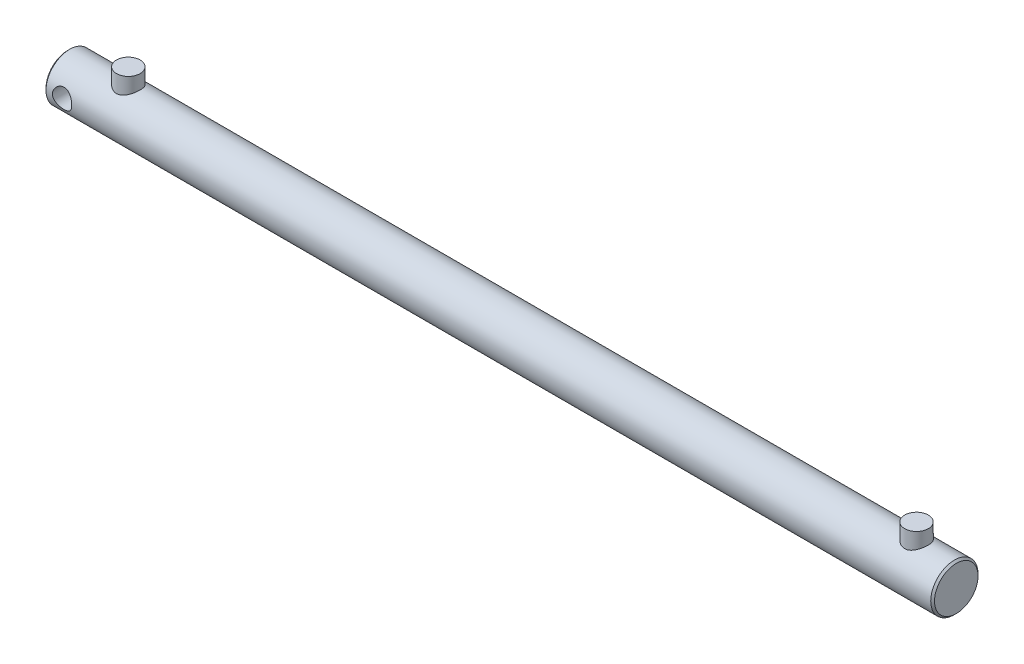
ISO-10303-21;
HEADER;
FILE_DESCRIPTION(('STEP AP214'),'2;1');
FILE_NAME('part.step','',(''),(''),'','','');
FILE_SCHEMA(('AUTOMOTIVE_DESIGN { 1 0 10303 214 1 1 1 1 }'));
ENDSEC;
DATA;
#1=APPLICATION_CONTEXT('core data for automotive mechanical design processes');
#2=APPLICATION_PROTOCOL_DEFINITION('international standard','automotive_design',2000,#1);
#3=PRODUCT_CONTEXT('',#1,'mechanical');
#4=PRODUCT('Part','Part','',(#3));
#5=PRODUCT_RELATED_PRODUCT_CATEGORY('part','',(#4));
#6=PRODUCT_DEFINITION_FORMATION('','',#4);
#7=PRODUCT_DEFINITION_CONTEXT('part definition',#1,'design');
#8=PRODUCT_DEFINITION('design','',#6,#7);
#9=PRODUCT_DEFINITION_SHAPE('','',#8);
#10=(LENGTH_UNIT() NAMED_UNIT(*) SI_UNIT(.MILLI.,.METRE.));
#11=(NAMED_UNIT(*) PLANE_ANGLE_UNIT() SI_UNIT($,.RADIAN.));
#12=(NAMED_UNIT(*) SI_UNIT($,.STERADIAN.) SOLID_ANGLE_UNIT());
#13=UNCERTAINTY_MEASURE_WITH_UNIT(LENGTH_MEASURE(1.E-05),#10,'distance_accuracy_value','');
#14=(GEOMETRIC_REPRESENTATION_CONTEXT(3) GLOBAL_UNCERTAINTY_ASSIGNED_CONTEXT((#13)) GLOBAL_UNIT_ASSIGNED_CONTEXT((#10,
#11,#12)) REPRESENTATION_CONTEXT('',''));
#15=CARTESIAN_POINT('',(0.,0.,0.));
#16=DIRECTION('',(0.,0.,1.));
#17=DIRECTION('',(1.,0.,0.));
#18=AXIS2_PLACEMENT_3D('',#15,#16,#17);
#19=CARTESIAN_POINT('',(-469.5,0.,0.));
#20=DIRECTION('',(-1.,0.,0.));
#21=DIRECTION('',(0.,0.,1.));
#22=AXIS2_PLACEMENT_3D('',#19,#20,#21);
#23=CYLINDRICAL_SURFACE('',#22,25.);
#24=CARTESIAN_POINT('',(-405.5,21.650635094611,-12.5));
#25=CARTESIAN_POINT('',(-405.825828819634,21.650636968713,-12.4999985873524));
#26=CARTESIAN_POINT('',(-406.151686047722,21.6580155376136,-12.4872432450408));
#27=CARTESIAN_POINT('',(-406.800889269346,21.6872558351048,-12.4363891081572));
#28=CARTESIAN_POINT('',(-407.12423402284,21.7091243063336,-12.3982785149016));
#29=CARTESIAN_POINT('',(-407.766364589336,21.7665787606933,-12.297130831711));
#30=CARTESIAN_POINT('',(-408.085140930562,21.802189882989,-12.2340480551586));
#31=CARTESIAN_POINT('',(-408.715226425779,21.8858435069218,-12.0837589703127));
#32=CARTESIAN_POINT('',(-409.026536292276,21.9338848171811,-11.9965549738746));
#33=CARTESIAN_POINT('',(-409.638091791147,22.0405000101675,-11.7995262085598));
#34=CARTESIAN_POINT('',(-409.938389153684,22.0990140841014,-11.6898294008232));
#35=CARTESIAN_POINT('',(-410.528172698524,22.2249725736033,-11.4485414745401));
#36=CARTESIAN_POINT('',(-410.817654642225,22.2924204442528,-11.3169418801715));
#37=CARTESIAN_POINT('',(-411.667464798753,22.5052717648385,-10.8909843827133));
#38=CARTESIAN_POINT('',(-412.2097361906,22.6612898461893,-10.5652792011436));
#39=CARTESIAN_POINT('',(-413.278979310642,22.9996468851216,-9.80822889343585));
#40=CARTESIAN_POINT('',(-413.801000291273,23.1830954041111,-9.37038644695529));
#41=CARTESIAN_POINT('',(-414.525932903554,23.4556474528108,-8.65437620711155));
#42=CARTESIAN_POINT('',(-414.758042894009,23.5461267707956,-8.4056273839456));
#43=CARTESIAN_POINT('',(-415.201667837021,23.7240607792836,-7.8894445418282));
#44=CARTESIAN_POINT('',(-415.413190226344,23.8115165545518,-7.62201733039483));
#45=CARTESIAN_POINT('',(-415.827960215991,23.9870610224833,-7.05096348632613));
#46=CARTESIAN_POINT('',(-416.029675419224,24.0747909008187,-6.74611185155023));
#47=CARTESIAN_POINT('',(-416.406506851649,24.2419754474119,-6.11818329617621));
#48=CARTESIAN_POINT('',(-416.581621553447,24.3214296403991,-5.79510533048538));
#49=CARTESIAN_POINT('',(-416.90343651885,24.4697359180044,-5.13293948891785));
#50=CARTESIAN_POINT('',(-417.050150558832,24.5385931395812,-4.7938594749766));
#51=CARTESIAN_POINT('',(-417.313578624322,24.6636816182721,-4.10199116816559));
#52=CARTESIAN_POINT('',(-417.430295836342,24.7199142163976,-3.7492043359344));
#53=CARTESIAN_POINT('',(-417.625035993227,24.8145076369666,-3.05827019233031));
#54=CARTESIAN_POINT('',(-417.705220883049,24.8538552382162,-2.72086672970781));
#55=CARTESIAN_POINT('',(-417.837413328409,24.9190379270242,-2.03929145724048));
#56=CARTESIAN_POINT('',(-417.889422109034,24.9448736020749,-1.69511994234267));
#57=CARTESIAN_POINT('',(-417.964549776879,24.9822725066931,-1.0030426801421));
#58=CARTESIAN_POINT('',(-417.987683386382,24.9938430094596,-0.655138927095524));
#59=CARTESIAN_POINT('',(-418.004785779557,25.0023919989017,0.0415551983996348));
#60=CARTESIAN_POINT('',(-417.998756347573,24.9993713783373,0.390345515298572));
#61=CARTESIAN_POINT('',(-417.959420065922,24.9797298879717,1.05545670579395));
#62=CARTESIAN_POINT('',(-417.928534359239,24.9643162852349,1.37196006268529));
#63=CARTESIAN_POINT('',(-417.842896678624,24.9217919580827,2.00090286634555));
#64=CARTESIAN_POINT('',(-417.788146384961,24.8946820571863,2.31334259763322));
#65=CARTESIAN_POINT('',(-417.655375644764,24.8294144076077,2.932058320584));
#66=CARTESIAN_POINT('',(-417.577354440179,24.7912562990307,3.2383341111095));
#67=CARTESIAN_POINT('',(-417.398835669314,24.7047808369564,3.84278923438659));
#68=CARTESIAN_POINT('',(-417.298337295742,24.6564631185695,4.14096827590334));
#69=CARTESIAN_POINT('',(-417.074267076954,24.5500266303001,4.73153890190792));
#70=CARTESIAN_POINT('',(-416.95039676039,24.4917821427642,5.02379438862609));
#71=CARTESIAN_POINT('',(-416.681577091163,24.367262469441,5.59664626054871));
#72=CARTESIAN_POINT('',(-416.536627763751,24.3009872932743,5.87724265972));
#73=CARTESIAN_POINT('',(-416.226722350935,24.1618170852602,6.42546402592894));
#74=CARTESIAN_POINT('',(-416.061764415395,24.0889214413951,6.69308779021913));
#75=CARTESIAN_POINT('',(-415.712866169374,23.9380009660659,7.21427443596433));
#76=CARTESIAN_POINT('',(-415.528918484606,23.859974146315,7.46783179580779));
#77=CARTESIAN_POINT('',(-415.124909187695,23.6928666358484,7.98299107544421));
#78=CARTESIAN_POINT('',(-414.903077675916,23.6034377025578,8.24309375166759));
#79=CARTESIAN_POINT('',(-414.439270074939,23.4225308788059,8.74390948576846));
#80=CARTESIAN_POINT('',(-414.197292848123,23.331052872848,8.9846214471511));
#81=CARTESIAN_POINT('',(-413.694268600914,23.1482419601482,9.44565668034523));
#82=CARTESIAN_POINT('',(-413.433209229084,23.0569091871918,9.66596653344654));
#83=CARTESIAN_POINT('',(-412.893337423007,22.876771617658,10.0849060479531));
#84=CARTESIAN_POINT('',(-412.614521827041,22.7879672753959,10.2835318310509));
#85=CARTESIAN_POINT('',(-412.022086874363,22.6097947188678,10.6698301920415));
#86=CARTESIAN_POINT('',(-411.70738198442,22.520752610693,10.8559934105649));
#87=CARTESIAN_POINT('',(-411.061183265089,22.3512779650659,11.2007713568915));
#88=CARTESIAN_POINT('',(-410.729697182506,22.2708415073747,11.3593986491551));
#89=CARTESIAN_POINT('',(-410.051996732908,22.1215174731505,11.6475234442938));
#90=CARTESIAN_POINT('',(-409.705791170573,22.0526231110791,11.7770380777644));
#91=CARTESIAN_POINT('',(-409.000945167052,21.9291206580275,12.0054389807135));
#92=CARTESIAN_POINT('',(-408.642306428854,21.8745106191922,12.1043294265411));
#93=CARTESIAN_POINT('',(-407.944369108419,21.7856557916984,12.26347567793));
#94=CARTESIAN_POINT('',(-407.605788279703,21.7501406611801,12.3261709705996));
#95=CARTESIAN_POINT('',(-406.923342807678,21.6947067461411,12.4234802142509));
#96=CARTESIAN_POINT('',(-406.579478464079,21.6747870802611,12.4580957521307));
#97=CARTESIAN_POINT('',(-405.889711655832,21.6514003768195,12.4986965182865));
#98=CARTESIAN_POINT('',(-405.543810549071,21.6479233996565,12.5046990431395));
#99=CARTESIAN_POINT('',(-404.852946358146,21.6575485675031,12.4880218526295));
#100=CARTESIAN_POINT('',(-404.507983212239,21.6706495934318,12.4653440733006));
#101=CARTESIAN_POINT('',(-403.859787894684,21.71053573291,12.3957257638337));
#102=CARTESIAN_POINT('',(-403.556131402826,21.7356609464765,12.3517217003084));
#103=CARTESIAN_POINT('',(-402.953946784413,21.7977675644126,12.2417856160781));
#104=CARTESIAN_POINT('',(-402.655420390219,21.8347528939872,12.1758463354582));
#105=CARTESIAN_POINT('',(-402.065469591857,21.919415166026,12.0227647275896));
#106=CARTESIAN_POINT('',(-401.774044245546,21.967090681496,11.9356252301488));
#107=CARTESIAN_POINT('',(-401.199706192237,22.0717635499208,11.7409310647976));
#108=CARTESIAN_POINT('',(-400.916796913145,22.12876459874,11.6333683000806));
#109=CARTESIAN_POINT('',(-400.348184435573,22.2533312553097,11.3933466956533));
#110=CARTESIAN_POINT('',(-400.062947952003,22.3212614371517,11.2599724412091));
#111=CARTESIAN_POINT('',(-399.504535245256,22.4638079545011,10.9728312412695));
#112=CARTESIAN_POINT('',(-399.231364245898,22.5384271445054,10.8190555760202));
#113=CARTESIAN_POINT('',(-398.698252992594,22.692479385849,10.4920939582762));
#114=CARTESIAN_POINT('',(-398.438315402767,22.7719133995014,10.3189041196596));
#115=CARTESIAN_POINT('',(-397.932706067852,22.933742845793,9.95405785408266));
#116=CARTESIAN_POINT('',(-397.687035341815,23.0161384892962,9.76240011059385));
#117=CARTESIAN_POINT('',(-397.180799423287,23.1925831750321,9.33615452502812));
#118=CARTESIAN_POINT('',(-396.922274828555,23.2867891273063,9.09920221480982));
#119=CARTESIAN_POINT('',(-396.425930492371,23.4741545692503,8.60430434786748));
#120=CARTESIAN_POINT('',(-396.1881046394,23.5673143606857,8.34636503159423));
#121=CARTESIAN_POINT('',(-395.734261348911,23.7502946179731,7.81048740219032));
#122=CARTESIAN_POINT('',(-395.518260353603,23.8401125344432,7.53253427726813));
#123=CARTESIAN_POINT('',(-395.109811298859,24.0139935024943,6.95830888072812));
#124=CARTESIAN_POINT('',(-394.917353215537,24.0980589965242,6.66204448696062));
#125=CARTESIAN_POINT('',(-394.552580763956,24.2604327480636,6.04450287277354));
#126=CARTESIAN_POINT('',(-394.380942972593,24.3385268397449,5.72276854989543));
#127=CARTESIAN_POINT('',(-394.065661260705,24.4841693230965,5.06353477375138));
#128=CARTESIAN_POINT('',(-393.922018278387,24.5517173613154,4.72603479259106));
#129=CARTESIAN_POINT('',(-393.664459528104,24.6742211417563,4.03792427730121));
#130=CARTESIAN_POINT('',(-393.55052252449,24.7291858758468,3.68732331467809));
#131=CARTESIAN_POINT('',(-393.353726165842,24.8248778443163,2.97561663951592));
#132=CARTESIAN_POINT('',(-393.270863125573,24.8656067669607,2.61451217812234));
#133=CARTESIAN_POINT('',(-393.143513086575,24.9284979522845,1.91850625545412));
#134=CARTESIAN_POINT('',(-393.096201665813,24.9520213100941,1.58424214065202));
#135=CARTESIAN_POINT('',(-393.028766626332,24.9856118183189,0.912314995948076));
#136=CARTESIAN_POINT('',(-393.00864128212,24.9956798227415,0.574652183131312));
#137=CARTESIAN_POINT('',(-392.995841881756,25.0020787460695,-0.10121992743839));
#138=CARTESIAN_POINT('',(-393.003159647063,24.9984137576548,-0.439429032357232));
#139=CARTESIAN_POINT('',(-393.045132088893,24.9774578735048,-1.11371445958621));
#140=CARTESIAN_POINT('',(-393.079786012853,24.96016735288,-1.44979084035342));
#141=CARTESIAN_POINT('',(-393.172800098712,24.9140191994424,-2.09506424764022));
#142=CARTESIAN_POINT('',(-393.229444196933,24.8860005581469,-2.4045710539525));
#143=CARTESIAN_POINT('',(-393.365571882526,24.8191625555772,-3.01730683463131));
#144=CARTESIAN_POINT('',(-393.445054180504,24.7803438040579,-3.32053616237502));
#145=CARTESIAN_POINT('',(-393.626075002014,24.6927888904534,-3.91887965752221));
#146=CARTESIAN_POINT('',(-393.727615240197,24.644051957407,-4.21399319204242));
#147=CARTESIAN_POINT('',(-393.951830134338,24.5377360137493,-4.79443241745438));
#148=CARTESIAN_POINT('',(-394.074505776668,24.4801565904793,-5.07975765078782));
#149=CARTESIAN_POINT('',(-394.345646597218,24.3547642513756,-5.6510696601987));
#150=CARTESIAN_POINT('',(-394.494986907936,24.2866201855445,-5.9365681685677));
#151=CARTESIAN_POINT('',(-394.814454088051,24.1435393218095,-6.49402514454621));
#152=CARTESIAN_POINT('',(-394.984588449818,24.0686000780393,-6.76597868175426));
#153=CARTESIAN_POINT('',(-395.344503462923,23.9135470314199,-7.29508667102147));
#154=CARTESIAN_POINT('',(-395.534288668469,23.8334320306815,-7.55223767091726));
#155=CARTESIAN_POINT('',(-395.93236125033,23.6697443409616,-8.05059010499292));
#156=CARTESIAN_POINT('',(-396.140648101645,23.5861717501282,-8.29179199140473));
#157=CARTESIAN_POINT('',(-396.596332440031,23.4089075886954,-8.78049915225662));
#158=CARTESIAN_POINT('',(-396.845558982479,23.3150375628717,-9.02623729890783));
#159=CARTESIAN_POINT('',(-397.363805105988,23.127673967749,-9.49603431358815));
#160=CARTESIAN_POINT('',(-397.632825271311,23.0341804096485,-9.72009254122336));
#161=CARTESIAN_POINT('',(-398.189584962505,22.8500132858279,-10.1454748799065));
#162=CARTESIAN_POINT('',(-398.477340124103,22.7593421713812,-10.3467796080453));
#163=CARTESIAN_POINT('',(-399.07002865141,22.5834994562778,-10.7251617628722));
#164=CARTESIAN_POINT('',(-399.374964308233,22.4983285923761,-10.9022359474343));
#165=CARTESIAN_POINT('',(-400.010467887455,22.3335584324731,-11.2360101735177));
#166=CARTESIAN_POINT('',(-400.341543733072,22.2542245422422,-11.3918772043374));
#167=CARTESIAN_POINT('',(-401.018159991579,22.1071923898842,-11.6746502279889));
#168=CARTESIAN_POINT('',(-401.363692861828,22.0394881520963,-11.801571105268));
#169=CARTESIAN_POINT('',(-402.066013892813,21.9185525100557,-12.0246888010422));
#170=CARTESIAN_POINT('',(-402.422770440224,21.8652839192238,-12.1209646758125));
#171=CARTESIAN_POINT('',(-403.145231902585,21.7753691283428,-12.2817688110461));
#172=CARTESIAN_POINT('',(-403.510930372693,21.738711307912,-12.346319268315));
#173=CARTESIAN_POINT('',(-404.147494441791,21.6911886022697,-12.4295575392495));
#174=CARTESIAN_POINT('',(-404.417060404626,21.6760179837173,-12.4559482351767));
#175=CARTESIAN_POINT('',(-404.957744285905,21.6557401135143,-12.4911706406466));
#176=CARTESIAN_POINT('',(-405.228862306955,21.6506335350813,-12.5000011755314));
#177=CARTESIAN_POINT('',(-405.5,21.650635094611,-12.5));
#178=B_SPLINE_CURVE_WITH_KNOTS('',3,(#24,#25,#26,#27,#28,#29,#30,#31,#32,#33,#34,#35,#36,#37,
#38,#39,#40,#41,#42,#43,#44,#45,#46,#47,#48,#49,#50,#51,#52,#53,#54,#55,#56,#57,#58,#59,#60,#61,
#62,#63,#64,#65,#66,#67,#68,#69,#70,#71,#72,#73,#74,#75,#76,#77,#78,#79,#80,#81,#82,#83,#84,#85,
#86,#87,#88,#89,#90,#91,#92,#93,#94,#95,#96,#97,#98,#99,#100,#101,#102,#103,#104,#105,#106,#107,
#108,#109,#110,#111,#112,#113,#114,#115,#116,#117,#118,#119,#120,#121,#122,#123,#124,#125,#126,
#127,#128,#129,#130,#131,#132,#133,#134,#135,#136,#137,#138,#139,#140,#141,#142,#143,#144,#145,
#146,#147,#148,#149,#150,#151,#152,#153,#154,#155,#156,#157,#158,#159,#160,#161,#162,#163,#164,
#165,#166,#167,#168,#169,#170,#171,#172,#173,#174,#175,#176,#177),.UNSPECIFIED.,.T.,.F.,(4,2,2,
2,2,2,2,2,2,2,2,2,2,2,2,2,2,2,2,2,2,2,2,2,2,2,2,2,2,2,2,2,2,2,2,2,2,2,2,2,2,2,2,2,2,2,2,2,2,2,2,
2,2,2,2,2,2,2,2,2,2,2,2,2,2,2,2,2,2,2,2,2,2,2,2,2,4),(0.,0.977205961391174,1.95486696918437,
2.93432493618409,3.91368906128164,4.88762893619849,5.86194658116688,7.80874820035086,
9.91611803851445,10.9713526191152,12.0262045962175,13.1525478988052,14.2789558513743,
15.4048160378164,16.5305565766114,17.576215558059,18.6218290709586,19.6669092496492,
20.7119254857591,21.6659378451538,22.6198830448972,23.5738593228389,24.5278698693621,
25.4950080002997,26.4621449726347,27.4293714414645,28.3969749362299,29.4558985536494,
30.5148820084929,31.5745570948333,32.6344214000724,33.7619649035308,34.8889925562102,
36.0153552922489,37.14156435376,38.17858119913,39.2155394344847,40.251870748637,
41.2881321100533,42.2106469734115,43.1334674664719,44.0561648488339,44.9792288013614,
45.9446183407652,46.9104218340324,47.8764189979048,48.8424850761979,49.9306247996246,
51.0184421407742,52.107072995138,53.1952387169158,54.3125134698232,55.4298256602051,
56.5463369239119,57.6627157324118,58.6766202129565,59.6904603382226,60.7039983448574,
61.7175084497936,62.6641089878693,63.6106560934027,64.5572768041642,65.5039417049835,
66.4908805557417,67.4781760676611,68.4657009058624,69.4531977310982,70.5391008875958,
71.6250361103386,72.71188954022,73.7988882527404,74.9206611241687,76.0418558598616,
77.1601343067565,78.2776292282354,79.0907545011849,79.9039341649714),.UNSPECIFIED.);
#179=CARTESIAN_POINT('',(-405.5,21.650635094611,-12.5));
#180=VERTEX_POINT('',#179);
#181=EDGE_CURVE('E39',#180,#180,#178,.T.);
#182=ORIENTED_EDGE('',*,*,#181,.F.);
#183=EDGE_LOOP('',(#182));
#184=FACE_BOUND('',#183,.T.);
#185=CARTESIAN_POINT('',(-440.3,0.,-25.));
#186=CARTESIAN_POINT('',(-440.300001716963,0.273789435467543,-24.9999986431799));
#187=CARTESIAN_POINT('',(-440.311038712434,0.547678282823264,-24.9954899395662));
#188=CARTESIAN_POINT('',(-440.355085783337,1.09351246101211,-24.9775677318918));
#189=CARTESIAN_POINT('',(-440.388110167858,1.36545640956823,-24.9641484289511));
#190=CARTESIAN_POINT('',(-440.475895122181,1.90589153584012,-24.9287196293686));
#191=CARTESIAN_POINT('',(-440.530705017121,2.17437344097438,-24.9066906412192));
#192=CARTESIAN_POINT('',(-440.661508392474,2.70533868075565,-24.8546237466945));
#193=CARTESIAN_POINT('',(-440.737503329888,2.96782160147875,-24.8245852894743));
#194=CARTESIAN_POINT('',(-440.909657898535,3.48412634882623,-24.7573909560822));
#195=CARTESIAN_POINT('',(-441.005747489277,3.73797478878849,-24.7202598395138));
#196=CARTESIAN_POINT('',(-441.217413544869,4.23637900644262,-24.6397409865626));
#197=CARTESIAN_POINT('',(-441.332990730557,4.48093443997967,-24.5963530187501));
#198=CARTESIAN_POINT('',(-441.582658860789,4.95920699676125,-24.5043977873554));
#199=CARTESIAN_POINT('',(-441.71673892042,5.19293038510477,-24.4558335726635));
#200=CARTESIAN_POINT('',(-442.002515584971,5.64846413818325,-24.3546587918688));
#201=CARTESIAN_POINT('',(-442.154218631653,5.87027010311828,-24.3020467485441));
#202=CARTESIAN_POINT('',(-442.648401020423,6.53495483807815,-24.1352121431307));
#203=CARTESIAN_POINT('',(-443.019052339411,6.95614665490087,-24.016166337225));
#204=CARTESIAN_POINT('',(-443.824387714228,7.73234580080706,-23.7776427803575));
#205=CARTESIAN_POINT('',(-444.259104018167,8.08731959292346,-23.6581648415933));
#206=CARTESIAN_POINT('',(-444.962487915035,8.57101087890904,-23.4855059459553));
#207=CARTESIAN_POINT('',(-445.211689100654,8.72699363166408,-23.4278402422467));
#208=CARTESIAN_POINT('',(-445.723454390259,9.01726356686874,-23.3176551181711));
#209=CARTESIAN_POINT('',(-445.986012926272,9.15155969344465,-23.2651335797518));
#210=CARTESIAN_POINT('',(-446.522800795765,9.39728813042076,-23.1669700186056));
#211=CARTESIAN_POINT('',(-446.797028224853,9.50872415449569,-23.1213268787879));
#212=CARTESIAN_POINT('',(-447.355281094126,9.70765251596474,-23.0385135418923));
#213=CARTESIAN_POINT('',(-447.63930583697,9.79514655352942,-23.0013427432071));
#214=CARTESIAN_POINT('',(-448.20152230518,9.94170066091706,-22.9383663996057));
#215=CARTESIAN_POINT('',(-448.479367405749,10.0018973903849,-22.9121113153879));
#216=CARTESIAN_POINT('',(-449.039859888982,10.0989538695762,-22.8694982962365));
#217=CARTESIAN_POINT('',(-449.322507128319,10.1358143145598,-22.8531400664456));
#218=CARTESIAN_POINT('',(-449.890181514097,10.1857387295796,-22.830932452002));
#219=CARTESIAN_POINT('',(-450.17520754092,10.1988133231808,-22.8250783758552));
#220=CARTESIAN_POINT('',(-450.745364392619,10.2010320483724,-22.8240871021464));
#221=CARTESIAN_POINT('',(-451.030495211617,10.1901773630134,-22.8289493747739));
#222=CARTESIAN_POINT('',(-451.577650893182,10.1463488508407,-22.8484597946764));
#223=CARTESIAN_POINT('',(-451.839838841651,10.1150529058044,-22.8623652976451));
#224=CARTESIAN_POINT('',(-452.360508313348,10.0323483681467,-22.8987778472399));
#225=CARTESIAN_POINT('',(-452.618988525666,9.98093283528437,-22.9212878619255));
#226=CARTESIAN_POINT('',(-453.130362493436,9.8585143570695,-22.9742057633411));
#227=CARTESIAN_POINT('',(-453.383257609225,9.78751623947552,-23.0046117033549));
#228=CARTESIAN_POINT('',(-453.882066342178,9.6265435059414,-23.0724355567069));
#229=CARTESIAN_POINT('',(-454.127977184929,9.53656146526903,-23.1098562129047));
#230=CARTESIAN_POINT('',(-454.616250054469,9.33635492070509,-23.1914724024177));
#231=CARTESIAN_POINT('',(-454.858437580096,9.22575520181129,-23.2357904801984));
#232=CARTESIAN_POINT('',(-455.332771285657,8.98637481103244,-23.3294145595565));
#233=CARTESIAN_POINT('',(-455.564913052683,8.85758625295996,-23.3787227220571));
#234=CARTESIAN_POINT('',(-456.017893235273,8.58271796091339,-23.4810232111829));
#235=CARTESIAN_POINT('',(-456.238730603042,8.43663662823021,-23.5340158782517));
#236=CARTESIAN_POINT('',(-456.668018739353,8.1280643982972,-23.6423625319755));
#237=CARTESIAN_POINT('',(-456.876468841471,7.965572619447,-23.6977166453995));
#238=CARTESIAN_POINT('',(-457.296327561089,7.61126566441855,-23.8139905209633));
#239=CARTESIAN_POINT('',(-457.506609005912,7.41814148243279,-23.8749980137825));
#240=CARTESIAN_POINT('',(-457.910247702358,7.01495391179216,-23.9965567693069));
#241=CARTESIAN_POINT('',(-458.103610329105,6.80489594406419,-24.0571081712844));
#242=CARTESIAN_POINT('',(-458.472422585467,6.36883544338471,-24.1762081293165));
#243=CARTESIAN_POINT('',(-458.647861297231,6.14282333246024,-24.2347554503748));
#244=CARTESIAN_POINT('',(-458.979444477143,5.67634341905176,-24.3482384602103));
#245=CARTESIAN_POINT('',(-459.135596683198,5.43588147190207,-24.4031755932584));
#246=CARTESIAN_POINT('',(-459.430678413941,4.93648649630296,-24.5091338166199));
#247=CARTESIAN_POINT('',(-459.569162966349,4.67726664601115,-24.5600446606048));
#248=CARTESIAN_POINT('',(-459.823651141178,4.14681343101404,-24.6551522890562));
#249=CARTESIAN_POINT('',(-459.939654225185,3.87557977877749,-24.6993489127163));
#250=CARTESIAN_POINT('',(-460.147996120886,3.3231426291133,-24.7797213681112));
#251=CARTESIAN_POINT('',(-460.240345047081,3.04194345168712,-24.8159006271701));
#252=CARTESIAN_POINT('',(-460.400441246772,2.47163195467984,-24.8791744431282));
#253=CARTESIAN_POINT('',(-460.468190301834,2.1825202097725,-24.9062696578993));
#254=CARTESIAN_POINT('',(-460.574934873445,1.61661942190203,-24.9491899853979));
#255=CARTESIAN_POINT('',(-460.615435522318,1.34015814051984,-24.9656030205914));
#256=CARTESIAN_POINT('',(-460.673625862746,0.784456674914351,-24.9892367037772));
#257=CARTESIAN_POINT('',(-460.691316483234,0.505216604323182,-24.9964577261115));
#258=CARTESIAN_POINT('',(-460.703688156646,-0.0537902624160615,-25.0015043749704));
#259=CARTESIAN_POINT('',(-460.698374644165,-0.333556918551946,-24.9993322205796));
#260=CARTESIAN_POINT('',(-460.66481007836,-0.891476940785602,-24.9856584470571));
#261=CARTESIAN_POINT('',(-460.636559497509,-1.16963033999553,-24.9741570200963));
#262=CARTESIAN_POINT('',(-460.559307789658,-1.70910499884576,-24.9429047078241));
#263=CARTESIAN_POINT('',(-460.511349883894,-1.9706007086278,-24.9235691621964));
#264=CARTESIAN_POINT('',(-460.395366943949,-2.48839302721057,-24.8772076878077));
#265=CARTESIAN_POINT('',(-460.327342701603,-2.74468984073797,-24.8501820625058));
#266=CARTESIAN_POINT('',(-460.171853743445,-3.25041966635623,-24.7891034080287));
#267=CARTESIAN_POINT('',(-460.084390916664,-3.49985334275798,-24.7550510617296));
#268=CARTESIAN_POINT('',(-459.890723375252,-3.99047626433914,-24.6807149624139));
#269=CARTESIAN_POINT('',(-459.784511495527,-4.23166231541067,-24.6404288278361));
#270=CARTESIAN_POINT('',(-459.550676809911,-4.71154370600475,-24.5532610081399));
#271=CARTESIAN_POINT('',(-459.422500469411,-4.94993951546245,-24.5062158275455));
#272=CARTESIAN_POINT('',(-459.148039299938,-5.41520072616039,-24.4076254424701));
#273=CARTESIAN_POINT('',(-459.001747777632,-5.64206182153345,-24.3560785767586));
#274=CARTESIAN_POINT('',(-458.692041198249,-6.08301428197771,-24.2497090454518));
#275=CARTESIAN_POINT('',(-458.528623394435,-6.29710359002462,-24.1948858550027));
#276=CARTESIAN_POINT('',(-458.185662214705,-6.71140238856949,-24.083253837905));
#277=CARTESIAN_POINT('',(-458.006118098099,-6.91161124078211,-24.0264449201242));
#278=CARTESIAN_POINT('',(-457.618984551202,-7.31043905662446,-23.9082343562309));
#279=CARTESIAN_POINT('',(-457.410315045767,-7.50799727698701,-23.8467860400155));
#280=CARTESIAN_POINT('',(-456.97699477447,-7.88485612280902,-23.7248448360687));
#281=CARTESIAN_POINT('',(-456.752350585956,-8.06416418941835,-23.6643515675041));
#282=CARTESIAN_POINT('',(-456.288119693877,-8.40359447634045,-23.5459537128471));
#283=CARTESIAN_POINT('',(-456.048523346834,-8.5637041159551,-23.4880508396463));
#284=CARTESIAN_POINT('',(-455.555996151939,-8.86340597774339,-23.3766035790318));
#285=CARTESIAN_POINT('',(-455.303071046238,-9.00300693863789,-23.3230573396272));
#286=CARTESIAN_POINT('',(-454.782108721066,-9.26224753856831,-23.2213352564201));
#287=CARTESIAN_POINT('',(-454.51392354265,-9.38161962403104,-23.1732338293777));
#288=CARTESIAN_POINT('',(-453.967252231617,-9.59710554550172,-23.0848248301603));
#289=CARTESIAN_POINT('',(-453.688770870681,-9.69323000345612,-23.0445137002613));
#290=CARTESIAN_POINT('',(-453.12354634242,-9.86123160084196,-22.9731245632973));
#291=CARTESIAN_POINT('',(-452.836806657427,-9.93311880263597,-22.9420427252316));
#292=CARTESIAN_POINT('',(-452.25726859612,-10.0518392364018,-22.890276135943));
#293=CARTESIAN_POINT('',(-451.964470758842,-10.098674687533,-22.8695904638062));
#294=CARTESIAN_POINT('',(-451.397283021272,-10.1641633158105,-22.840555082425));
#295=CARTESIAN_POINT('',(-451.123145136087,-10.1846546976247,-22.8314017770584));
#296=CARTESIAN_POINT('',(-450.573963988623,-10.2034310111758,-22.8230170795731));
#297=CARTESIAN_POINT('',(-450.298920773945,-10.2017170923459,-22.823785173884));
#298=CARTESIAN_POINT('',(-449.750116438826,-10.176105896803,-22.8352153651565));
#299=CARTESIAN_POINT('',(-449.476355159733,-10.1522114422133,-22.8458762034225));
#300=CARTESIAN_POINT('',(-448.932183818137,-10.0825193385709,-22.8767185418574));
#301=CARTESIAN_POINT('',(-448.661773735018,-10.0367218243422,-22.8968999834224));
#302=CARTESIAN_POINT('',(-448.137843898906,-9.92616689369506,-22.945035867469));
#303=CARTESIAN_POINT('',(-447.884098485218,-9.86231170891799,-22.9726178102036));
#304=CARTESIAN_POINT('',(-447.382997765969,-9.71557925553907,-23.03505747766));
#305=CARTESIAN_POINT('',(-447.135644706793,-9.63269539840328,-23.0699177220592));
#306=CARTESIAN_POINT('',(-446.648856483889,-9.44861946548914,-23.1459174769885));
#307=CARTESIAN_POINT('',(-446.409421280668,-9.34742748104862,-23.1870569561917));
#308=CARTESIAN_POINT('',(-445.939722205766,-9.1274928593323,-23.2745112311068));
#309=CARTESIAN_POINT('',(-445.709459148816,-9.00874866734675,-23.3208264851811));
#310=CARTESIAN_POINT('',(-445.246047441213,-8.74704987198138,-23.4202869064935));
#311=CARTESIAN_POINT('',(-445.013521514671,-8.60308382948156,-23.4736733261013));
#312=CARTESIAN_POINT('',(-444.561253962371,-8.29733760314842,-23.5834808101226));
#313=CARTESIAN_POINT('',(-444.341512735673,-8.13555686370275,-23.6399019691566));
#314=CARTESIAN_POINT('',(-443.91587364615,-7.79509906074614,-23.7543403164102));
#315=CARTESIAN_POINT('',(-443.709979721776,-7.6164172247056,-23.8123579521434));
#316=CARTESIAN_POINT('',(-443.313168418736,-7.24317940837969,-23.9285300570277));
#317=CARTESIAN_POINT('',(-443.122251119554,-7.04862334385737,-23.9866845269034));
#318=CARTESIAN_POINT('',(-442.743809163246,-6.63071217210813,-24.1056847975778));
#319=CARTESIAN_POINT('',(-442.55742501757,-6.40629638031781,-24.1664398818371));
#320=CARTESIAN_POINT('',(-442.204265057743,-5.941873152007,-24.2848006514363));
#321=CARTESIAN_POINT('',(-442.037482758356,-5.7018709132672,-24.342407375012));
#322=CARTESIAN_POINT('',(-441.724582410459,-5.20746466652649,-24.4529448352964));
#323=CARTESIAN_POINT('',(-441.578479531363,-4.95305027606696,-24.5058721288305));
#324=CARTESIAN_POINT('',(-441.308321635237,-4.43161956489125,-24.6055111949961));
#325=CARTESIAN_POINT('',(-441.184264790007,-4.16460429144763,-24.6522234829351));
#326=CARTESIAN_POINT('',(-440.961330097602,-3.62458274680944,-24.7373360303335));
#327=CARTESIAN_POINT('',(-440.862047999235,-3.3517642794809,-24.7758679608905));
#328=CARTESIAN_POINT('',(-440.686882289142,-2.79769806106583,-24.8445322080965));
#329=CARTESIAN_POINT('',(-440.610996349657,-2.51645115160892,-24.8746653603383));
#330=CARTESIAN_POINT('',(-440.483615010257,-1.94846806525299,-24.925580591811));
#331=CARTESIAN_POINT('',(-440.432054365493,-1.66174874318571,-24.9463876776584));
#332=CARTESIAN_POINT('',(-440.353648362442,-1.08455530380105,-24.9781334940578));
#333=CARTESIAN_POINT('',(-440.326784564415,-0.794084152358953,-24.9890795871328));
#334=CARTESIAN_POINT('',(-440.308274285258,-0.419253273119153,-24.9966251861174));
#335=CARTESIAN_POINT('',(-440.305172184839,-0.33544046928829,-24.9978901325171));
#336=CARTESIAN_POINT('',(-440.301034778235,-0.167754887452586,-24.9995777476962));
#337=CARTESIAN_POINT('',(-440.299999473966,-0.0838821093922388,-25.0000004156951));
#338=CARTESIAN_POINT('',(-440.3,0.,-25.));
#339=B_SPLINE_CURVE_WITH_KNOTS('',3,(#185,#186,#187,#188,#189,#190,#191,#192,#193,#194,#195,
#196,#197,#198,#199,#200,#201,#202,#203,#204,#205,#206,#207,#208,#209,#210,#211,#212,#213,#214,
#215,#216,#217,#218,#219,#220,#221,#222,#223,#224,#225,#226,#227,#228,#229,#230,#231,#232,#233,
#234,#235,#236,#237,#238,#239,#240,#241,#242,#243,#244,#245,#246,#247,#248,#249,#250,#251,#252,
#253,#254,#255,#256,#257,#258,#259,#260,#261,#262,#263,#264,#265,#266,#267,#268,#269,#270,#271,
#272,#273,#274,#275,#276,#277,#278,#279,#280,#281,#282,#283,#284,#285,#286,#287,#288,#289,#290,
#291,#292,#293,#294,#295,#296,#297,#298,#299,#300,#301,#302,#303,#304,#305,#306,#307,#308,#309,
#310,#311,#312,#313,#314,#315,#316,#317,#318,#319,#320,#321,#322,#323,#324,#325,#326,#327,#328,
#329,#330,#331,#332,#333,#334,#335,#336,#337,#338),.UNSPECIFIED.,.T.,.F.,(4,2,2,2,2,2,2,2,2,2,2,
2,2,2,2,2,2,2,2,2,2,2,2,2,2,2,2,2,2,2,2,2,2,2,2,2,2,2,2,2,2,2,2,2,2,2,2,2,2,2,2,2,2,2,2,2,2,2,2,
2,2,2,2,2,2,2,2,2,2,2,2,2,2,2,2,2,4),(0.,0.821282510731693,1.64310002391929,2.46678893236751,
3.29053450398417,4.11145536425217,4.93240659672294,5.75287692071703,6.57364810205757,
8.28632730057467,9.99987156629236,10.897704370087,11.7951659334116,12.6924815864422,
13.5897335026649,14.4451011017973,15.3004432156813,16.1554032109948,17.010320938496,
17.8026371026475,18.5952268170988,19.3876213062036,20.1803262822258,20.9891888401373,
21.7984031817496,22.6076923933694,23.4170251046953,24.2918919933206,25.1664799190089,
26.0415974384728,26.9163627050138,27.8100268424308,28.7037123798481,29.5970151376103,
30.4902531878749,31.3288614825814,32.1674356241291,33.0058116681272,33.8441704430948,
34.6429279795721,35.4416540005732,36.2403024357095,37.0392567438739,37.8625419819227,
38.686132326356,39.5098549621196,40.3336154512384,41.2141546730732,42.0943334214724,
42.9750858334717,43.8554618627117,44.7467007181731,45.6375315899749,46.5279921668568,
47.418373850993,48.2424819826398,49.0665474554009,49.8905080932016,50.7144636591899,
51.5029072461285,52.2916242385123,53.0803372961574,53.8691202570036,54.7041620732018,
55.5392299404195,56.374534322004,57.2098431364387,58.1027169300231,58.9952944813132,
59.8885234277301,60.7816782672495,61.6591338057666,62.5365020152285,63.4115033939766,
64.2858509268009,64.5374707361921,64.7890907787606),.UNSPECIFIED.);
#340=CARTESIAN_POINT('',(-440.3,0.,-25.));
#341=VERTEX_POINT('',#340);
#342=EDGE_CURVE('E43',#341,#341,#339,.T.);
#343=ORIENTED_EDGE('',*,*,#342,.T.);
#344=EDGE_LOOP('',(#343));
#345=FACE_BOUND('',#344,.T.);
#346=CARTESIAN_POINT('',(-440.3,0.,25.));
#347=CARTESIAN_POINT('',(-440.300001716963,-0.273789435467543,24.9999986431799));
#348=CARTESIAN_POINT('',(-440.311038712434,-0.547678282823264,24.9954899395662));
#349=CARTESIAN_POINT('',(-440.355085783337,-1.09351246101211,24.9775677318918));
#350=CARTESIAN_POINT('',(-440.388110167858,-1.36545640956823,24.9641484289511));
#351=CARTESIAN_POINT('',(-440.475895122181,-1.90589153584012,24.9287196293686));
#352=CARTESIAN_POINT('',(-440.530705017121,-2.17437344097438,24.9066906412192));
#353=CARTESIAN_POINT('',(-440.661508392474,-2.70533868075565,24.8546237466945));
#354=CARTESIAN_POINT('',(-440.737503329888,-2.96782160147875,24.8245852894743));
#355=CARTESIAN_POINT('',(-440.909657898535,-3.48412634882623,24.7573909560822));
#356=CARTESIAN_POINT('',(-441.005747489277,-3.73797478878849,24.7202598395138));
#357=CARTESIAN_POINT('',(-441.217413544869,-4.23637900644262,24.6397409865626));
#358=CARTESIAN_POINT('',(-441.332990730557,-4.48093443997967,24.5963530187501));
#359=CARTESIAN_POINT('',(-441.582658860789,-4.95920699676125,24.5043977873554));
#360=CARTESIAN_POINT('',(-441.71673892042,-5.19293038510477,24.4558335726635));
#361=CARTESIAN_POINT('',(-442.002515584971,-5.64846413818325,24.3546587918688));
#362=CARTESIAN_POINT('',(-442.154218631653,-5.87027010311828,24.3020467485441));
#363=CARTESIAN_POINT('',(-442.648401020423,-6.53495483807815,24.1352121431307));
#364=CARTESIAN_POINT('',(-443.019052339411,-6.95614665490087,24.016166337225));
#365=CARTESIAN_POINT('',(-443.824387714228,-7.73234580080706,23.7776427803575));
#366=CARTESIAN_POINT('',(-444.259104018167,-8.08731959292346,23.6581648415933));
#367=CARTESIAN_POINT('',(-444.962487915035,-8.57101087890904,23.4855059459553));
#368=CARTESIAN_POINT('',(-445.211689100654,-8.72699363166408,23.4278402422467));
#369=CARTESIAN_POINT('',(-445.723454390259,-9.01726356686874,23.3176551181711));
#370=CARTESIAN_POINT('',(-445.986012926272,-9.15155969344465,23.2651335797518));
#371=CARTESIAN_POINT('',(-446.522800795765,-9.39728813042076,23.1669700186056));
#372=CARTESIAN_POINT('',(-446.797028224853,-9.50872415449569,23.1213268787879));
#373=CARTESIAN_POINT('',(-447.355281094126,-9.70765251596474,23.0385135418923));
#374=CARTESIAN_POINT('',(-447.63930583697,-9.79514655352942,23.0013427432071));
#375=CARTESIAN_POINT('',(-448.20152230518,-9.94170066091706,22.9383663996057));
#376=CARTESIAN_POINT('',(-448.479367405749,-10.0018973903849,22.9121113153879));
#377=CARTESIAN_POINT('',(-449.039859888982,-10.0989538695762,22.8694982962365));
#378=CARTESIAN_POINT('',(-449.322507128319,-10.1358143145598,22.8531400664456));
#379=CARTESIAN_POINT('',(-449.890181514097,-10.1857387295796,22.830932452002));
#380=CARTESIAN_POINT('',(-450.17520754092,-10.1988133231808,22.8250783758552));
#381=CARTESIAN_POINT('',(-450.745364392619,-10.2010320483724,22.8240871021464));
#382=CARTESIAN_POINT('',(-451.030495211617,-10.1901773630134,22.8289493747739));
#383=CARTESIAN_POINT('',(-451.577650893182,-10.1463488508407,22.8484597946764));
#384=CARTESIAN_POINT('',(-451.839838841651,-10.1150529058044,22.8623652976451));
#385=CARTESIAN_POINT('',(-452.360508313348,-10.0323483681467,22.8987778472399));
#386=CARTESIAN_POINT('',(-452.618988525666,-9.98093283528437,22.9212878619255));
#387=CARTESIAN_POINT('',(-453.130362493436,-9.8585143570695,22.9742057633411));
#388=CARTESIAN_POINT('',(-453.383257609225,-9.78751623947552,23.0046117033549));
#389=CARTESIAN_POINT('',(-453.882066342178,-9.6265435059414,23.0724355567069));
#390=CARTESIAN_POINT('',(-454.127977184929,-9.53656146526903,23.1098562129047));
#391=CARTESIAN_POINT('',(-454.616250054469,-9.33635492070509,23.1914724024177));
#392=CARTESIAN_POINT('',(-454.858437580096,-9.22575520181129,23.2357904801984));
#393=CARTESIAN_POINT('',(-455.332771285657,-8.98637481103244,23.3294145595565));
#394=CARTESIAN_POINT('',(-455.564913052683,-8.85758625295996,23.3787227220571));
#395=CARTESIAN_POINT('',(-456.017893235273,-8.58271796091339,23.4810232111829));
#396=CARTESIAN_POINT('',(-456.238730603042,-8.43663662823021,23.5340158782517));
#397=CARTESIAN_POINT('',(-456.668018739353,-8.1280643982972,23.6423625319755));
#398=CARTESIAN_POINT('',(-456.876468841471,-7.965572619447,23.6977166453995));
#399=CARTESIAN_POINT('',(-457.296327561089,-7.61126566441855,23.8139905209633));
#400=CARTESIAN_POINT('',(-457.506609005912,-7.41814148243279,23.8749980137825));
#401=CARTESIAN_POINT('',(-457.910247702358,-7.01495391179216,23.9965567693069));
#402=CARTESIAN_POINT('',(-458.103610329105,-6.80489594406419,24.0571081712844));
#403=CARTESIAN_POINT('',(-458.472422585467,-6.36883544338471,24.1762081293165));
#404=CARTESIAN_POINT('',(-458.647861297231,-6.14282333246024,24.2347554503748));
#405=CARTESIAN_POINT('',(-458.979444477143,-5.67634341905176,24.3482384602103));
#406=CARTESIAN_POINT('',(-459.135596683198,-5.43588147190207,24.4031755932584));
#407=CARTESIAN_POINT('',(-459.430678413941,-4.93648649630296,24.5091338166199));
#408=CARTESIAN_POINT('',(-459.569162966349,-4.67726664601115,24.5600446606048));
#409=CARTESIAN_POINT('',(-459.823651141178,-4.14681343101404,24.6551522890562));
#410=CARTESIAN_POINT('',(-459.939654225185,-3.87557977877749,24.6993489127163));
#411=CARTESIAN_POINT('',(-460.147996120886,-3.3231426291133,24.7797213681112));
#412=CARTESIAN_POINT('',(-460.240345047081,-3.04194345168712,24.8159006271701));
#413=CARTESIAN_POINT('',(-460.400441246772,-2.47163195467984,24.8791744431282));
#414=CARTESIAN_POINT('',(-460.468190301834,-2.1825202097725,24.9062696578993));
#415=CARTESIAN_POINT('',(-460.574934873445,-1.61661942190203,24.9491899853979));
#416=CARTESIAN_POINT('',(-460.615435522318,-1.34015814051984,24.9656030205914));
#417=CARTESIAN_POINT('',(-460.673625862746,-0.784456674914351,24.9892367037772));
#418=CARTESIAN_POINT('',(-460.691316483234,-0.505216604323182,24.9964577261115));
#419=CARTESIAN_POINT('',(-460.703688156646,0.0537902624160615,25.0015043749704));
#420=CARTESIAN_POINT('',(-460.698374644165,0.333556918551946,24.9993322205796));
#421=CARTESIAN_POINT('',(-460.66481007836,0.891476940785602,24.9856584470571));
#422=CARTESIAN_POINT('',(-460.636559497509,1.16963033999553,24.9741570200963));
#423=CARTESIAN_POINT('',(-460.559307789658,1.70910499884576,24.9429047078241));
#424=CARTESIAN_POINT('',(-460.511349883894,1.9706007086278,24.9235691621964));
#425=CARTESIAN_POINT('',(-460.395366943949,2.48839302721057,24.8772076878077));
#426=CARTESIAN_POINT('',(-460.327342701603,2.74468984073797,24.8501820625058));
#427=CARTESIAN_POINT('',(-460.171853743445,3.25041966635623,24.7891034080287));
#428=CARTESIAN_POINT('',(-460.084390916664,3.49985334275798,24.7550510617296));
#429=CARTESIAN_POINT('',(-459.890723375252,3.99047626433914,24.6807149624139));
#430=CARTESIAN_POINT('',(-459.784511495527,4.23166231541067,24.6404288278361));
#431=CARTESIAN_POINT('',(-459.550676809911,4.71154370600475,24.5532610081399));
#432=CARTESIAN_POINT('',(-459.422500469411,4.94993951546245,24.5062158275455));
#433=CARTESIAN_POINT('',(-459.148039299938,5.41520072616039,24.4076254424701));
#434=CARTESIAN_POINT('',(-459.001747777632,5.64206182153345,24.3560785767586));
#435=CARTESIAN_POINT('',(-458.692041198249,6.08301428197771,24.2497090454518));
#436=CARTESIAN_POINT('',(-458.528623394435,6.29710359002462,24.1948858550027));
#437=CARTESIAN_POINT('',(-458.185662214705,6.71140238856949,24.083253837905));
#438=CARTESIAN_POINT('',(-458.006118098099,6.91161124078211,24.0264449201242));
#439=CARTESIAN_POINT('',(-457.618984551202,7.31043905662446,23.9082343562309));
#440=CARTESIAN_POINT('',(-457.410315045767,7.50799727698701,23.8467860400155));
#441=CARTESIAN_POINT('',(-456.97699477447,7.88485612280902,23.7248448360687));
#442=CARTESIAN_POINT('',(-456.752350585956,8.06416418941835,23.6643515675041));
#443=CARTESIAN_POINT('',(-456.288119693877,8.40359447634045,23.5459537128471));
#444=CARTESIAN_POINT('',(-456.048523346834,8.5637041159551,23.4880508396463));
#445=CARTESIAN_POINT('',(-455.555996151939,8.86340597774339,23.3766035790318));
#446=CARTESIAN_POINT('',(-455.303071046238,9.00300693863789,23.3230573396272));
#447=CARTESIAN_POINT('',(-454.782108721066,9.26224753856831,23.2213352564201));
#448=CARTESIAN_POINT('',(-454.51392354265,9.38161962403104,23.1732338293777));
#449=CARTESIAN_POINT('',(-453.967252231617,9.59710554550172,23.0848248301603));
#450=CARTESIAN_POINT('',(-453.688770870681,9.69323000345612,23.0445137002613));
#451=CARTESIAN_POINT('',(-453.12354634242,9.86123160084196,22.9731245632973));
#452=CARTESIAN_POINT('',(-452.836806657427,9.93311880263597,22.9420427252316));
#453=CARTESIAN_POINT('',(-452.25726859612,10.0518392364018,22.890276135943));
#454=CARTESIAN_POINT('',(-451.964470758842,10.098674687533,22.8695904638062));
#455=CARTESIAN_POINT('',(-451.397283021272,10.1641633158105,22.840555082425));
#456=CARTESIAN_POINT('',(-451.123145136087,10.1846546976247,22.8314017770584));
#457=CARTESIAN_POINT('',(-450.573963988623,10.2034310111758,22.8230170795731));
#458=CARTESIAN_POINT('',(-450.298920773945,10.2017170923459,22.823785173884));
#459=CARTESIAN_POINT('',(-449.750116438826,10.176105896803,22.8352153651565));
#460=CARTESIAN_POINT('',(-449.476355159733,10.1522114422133,22.8458762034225));
#461=CARTESIAN_POINT('',(-448.932183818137,10.0825193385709,22.8767185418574));
#462=CARTESIAN_POINT('',(-448.661773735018,10.0367218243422,22.8968999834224));
#463=CARTESIAN_POINT('',(-448.137843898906,9.92616689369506,22.945035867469));
#464=CARTESIAN_POINT('',(-447.884098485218,9.86231170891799,22.9726178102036));
#465=CARTESIAN_POINT('',(-447.382997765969,9.71557925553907,23.03505747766));
#466=CARTESIAN_POINT('',(-447.135644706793,9.63269539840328,23.0699177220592));
#467=CARTESIAN_POINT('',(-446.648856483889,9.44861946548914,23.1459174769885));
#468=CARTESIAN_POINT('',(-446.409421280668,9.34742748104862,23.1870569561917));
#469=CARTESIAN_POINT('',(-445.939722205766,9.1274928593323,23.2745112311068));
#470=CARTESIAN_POINT('',(-445.709459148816,9.00874866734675,23.3208264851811));
#471=CARTESIAN_POINT('',(-445.246047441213,8.74704987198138,23.4202869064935));
#472=CARTESIAN_POINT('',(-445.013521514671,8.60308382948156,23.4736733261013));
#473=CARTESIAN_POINT('',(-444.561253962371,8.29733760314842,23.5834808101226));
#474=CARTESIAN_POINT('',(-444.341512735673,8.13555686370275,23.6399019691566));
#475=CARTESIAN_POINT('',(-443.91587364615,7.79509906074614,23.7543403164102));
#476=CARTESIAN_POINT('',(-443.709979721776,7.6164172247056,23.8123579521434));
#477=CARTESIAN_POINT('',(-443.313168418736,7.24317940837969,23.9285300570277));
#478=CARTESIAN_POINT('',(-443.122251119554,7.04862334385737,23.9866845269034));
#479=CARTESIAN_POINT('',(-442.743809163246,6.63071217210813,24.1056847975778));
#480=CARTESIAN_POINT('',(-442.55742501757,6.40629638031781,24.1664398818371));
#481=CARTESIAN_POINT('',(-442.204265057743,5.941873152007,24.2848006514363));
#482=CARTESIAN_POINT('',(-442.037482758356,5.7018709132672,24.342407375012));
#483=CARTESIAN_POINT('',(-441.724582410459,5.20746466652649,24.4529448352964));
#484=CARTESIAN_POINT('',(-441.578479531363,4.95305027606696,24.5058721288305));
#485=CARTESIAN_POINT('',(-441.308321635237,4.43161956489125,24.6055111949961));
#486=CARTESIAN_POINT('',(-441.184264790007,4.16460429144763,24.6522234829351));
#487=CARTESIAN_POINT('',(-440.961330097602,3.62458274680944,24.7373360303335));
#488=CARTESIAN_POINT('',(-440.862047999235,3.3517642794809,24.7758679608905));
#489=CARTESIAN_POINT('',(-440.686882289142,2.79769806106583,24.8445322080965));
#490=CARTESIAN_POINT('',(-440.610996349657,2.51645115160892,24.8746653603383));
#491=CARTESIAN_POINT('',(-440.483615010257,1.94846806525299,24.925580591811));
#492=CARTESIAN_POINT('',(-440.432054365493,1.66174874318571,24.9463876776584));
#493=CARTESIAN_POINT('',(-440.353648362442,1.08455530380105,24.9781334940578));
#494=CARTESIAN_POINT('',(-440.326784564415,0.794084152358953,24.9890795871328));
#495=CARTESIAN_POINT('',(-440.308274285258,0.419253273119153,24.9966251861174));
#496=CARTESIAN_POINT('',(-440.305172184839,0.33544046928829,24.9978901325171));
#497=CARTESIAN_POINT('',(-440.301034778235,0.167754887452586,24.9995777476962));
#498=CARTESIAN_POINT('',(-440.299999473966,0.0838821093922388,25.0000004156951));
#499=CARTESIAN_POINT('',(-440.3,0.,25.));
#500=B_SPLINE_CURVE_WITH_KNOTS('',3,(#346,#347,#348,#349,#350,#351,#352,#353,#354,#355,#356,
#357,#358,#359,#360,#361,#362,#363,#364,#365,#366,#367,#368,#369,#370,#371,#372,#373,#374,#375,
#376,#377,#378,#379,#380,#381,#382,#383,#384,#385,#386,#387,#388,#389,#390,#391,#392,#393,#394,
#395,#396,#397,#398,#399,#400,#401,#402,#403,#404,#405,#406,#407,#408,#409,#410,#411,#412,#413,
#414,#415,#416,#417,#418,#419,#420,#421,#422,#423,#424,#425,#426,#427,#428,#429,#430,#431,#432,
#433,#434,#435,#436,#437,#438,#439,#440,#441,#442,#443,#444,#445,#446,#447,#448,#449,#450,#451,
#452,#453,#454,#455,#456,#457,#458,#459,#460,#461,#462,#463,#464,#465,#466,#467,#468,#469,#470,
#471,#472,#473,#474,#475,#476,#477,#478,#479,#480,#481,#482,#483,#484,#485,#486,#487,#488,#489,
#490,#491,#492,#493,#494,#495,#496,#497,#498,#499),.UNSPECIFIED.,.T.,.F.,(4,2,2,2,2,2,2,2,2,2,2,
2,2,2,2,2,2,2,2,2,2,2,2,2,2,2,2,2,2,2,2,2,2,2,2,2,2,2,2,2,2,2,2,2,2,2,2,2,2,2,2,2,2,2,2,2,2,2,2,
2,2,2,2,2,2,2,2,2,2,2,2,2,2,2,2,2,4),(0.,0.821282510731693,1.64310002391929,2.46678893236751,
3.29053450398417,4.11145536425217,4.93240659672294,5.75287692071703,6.57364810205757,
8.28632730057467,9.99987156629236,10.897704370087,11.7951659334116,12.6924815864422,
13.5897335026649,14.4451011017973,15.3004432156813,16.1554032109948,17.010320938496,
17.8026371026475,18.5952268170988,19.3876213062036,20.1803262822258,20.9891888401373,
21.7984031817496,22.6076923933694,23.4170251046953,24.2918919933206,25.1664799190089,
26.0415974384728,26.9163627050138,27.8100268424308,28.7037123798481,29.5970151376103,
30.4902531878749,31.3288614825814,32.1674356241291,33.0058116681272,33.8441704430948,
34.6429279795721,35.4416540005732,36.2403024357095,37.0392567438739,37.8625419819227,
38.686132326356,39.5098549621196,40.3336154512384,41.2141546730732,42.0943334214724,
42.9750858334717,43.8554618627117,44.7467007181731,45.6375315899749,46.5279921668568,
47.418373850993,48.2424819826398,49.0665474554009,49.8905080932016,50.7144636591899,
51.5029072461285,52.2916242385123,53.0803372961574,53.8691202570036,54.7041620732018,
55.5392299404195,56.374534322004,57.2098431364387,58.1027169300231,58.9952944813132,
59.8885234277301,60.7816782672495,61.6591338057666,62.5365020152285,63.4115033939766,
64.2858509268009,64.5374707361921,64.7890907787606),.UNSPECIFIED.);
#501=CARTESIAN_POINT('',(-440.3,0.,25.));
#502=VERTEX_POINT('',#501);
#503=EDGE_CURVE('E47',#502,#502,#500,.T.);
#504=ORIENTED_EDGE('',*,*,#503,.T.);
#505=EDGE_LOOP('',(#504));
#506=FACE_BOUND('',#505,.T.);
#507=CARTESIAN_POINT('',(467.5,0.,0.));
#508=DIRECTION('',(-1.,0.,0.));
#509=DIRECTION('',(0.,0.,1.));
#510=AXIS2_PLACEMENT_3D('',#507,#508,#509);
#511=CIRCLE('',#510,25.);
#512=CARTESIAN_POINT('',(467.5,0.,25.));
#513=VERTEX_POINT('',#512);
#514=EDGE_CURVE('E82',#513,#513,#511,.T.);
#515=ORIENTED_EDGE('',*,*,#514,.T.);
#516=EDGE_LOOP('',(#515));
#517=FACE_BOUND('',#516,.T.);
#518=CARTESIAN_POINT('',(-467.5,0.,0.));
#519=DIRECTION('',(1.,0.,0.));
#520=DIRECTION('',(0.,0.,-1.));
#521=AXIS2_PLACEMENT_3D('',#518,#519,#520);
#522=CIRCLE('',#521,25.);
#523=CARTESIAN_POINT('',(-467.5,0.,-25.));
#524=VERTEX_POINT('',#523);
#525=EDGE_CURVE('E85',#524,#524,#522,.T.);
#526=ORIENTED_EDGE('',*,*,#525,.T.);
#527=EDGE_LOOP('',(#526));
#528=FACE_BOUND('',#527,.T.);
#529=CARTESIAN_POINT('',(427.5,21.650635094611,-12.5));
#530=CARTESIAN_POINT('',(427.174171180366,21.650636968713,-12.4999985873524));
#531=CARTESIAN_POINT('',(426.848313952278,21.6580155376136,-12.4872432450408));
#532=CARTESIAN_POINT('',(426.199110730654,21.6872558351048,-12.4363891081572));
#533=CARTESIAN_POINT('',(425.87576597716,21.7091243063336,-12.3982785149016));
#534=CARTESIAN_POINT('',(425.233635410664,21.7665787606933,-12.297130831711));
#535=CARTESIAN_POINT('',(424.914859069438,21.802189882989,-12.2340480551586));
#536=CARTESIAN_POINT('',(424.284773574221,21.8858435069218,-12.0837589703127));
#537=CARTESIAN_POINT('',(423.973463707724,21.9338848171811,-11.9965549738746));
#538=CARTESIAN_POINT('',(423.361908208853,22.0405000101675,-11.7995262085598));
#539=CARTESIAN_POINT('',(423.061610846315,22.0990140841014,-11.6898294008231));
#540=CARTESIAN_POINT('',(422.471827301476,22.2249725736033,-11.44854147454));
#541=CARTESIAN_POINT('',(422.182345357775,22.2924204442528,-11.3169418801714));
#542=CARTESIAN_POINT('',(421.332535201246,22.5052717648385,-10.8909843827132));
#543=CARTESIAN_POINT('',(420.7902638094,22.6612898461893,-10.5652792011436));
#544=CARTESIAN_POINT('',(419.721020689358,22.9996468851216,-9.80822889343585));
#545=CARTESIAN_POINT('',(419.198999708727,23.1830954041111,-9.37038644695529));
#546=CARTESIAN_POINT('',(418.474067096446,23.4556474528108,-8.65437620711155));
#547=CARTESIAN_POINT('',(418.24195710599,23.5461267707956,-8.4056273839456));
#548=CARTESIAN_POINT('',(417.798332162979,23.7240607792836,-7.8894445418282));
#549=CARTESIAN_POINT('',(417.586809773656,23.8115165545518,-7.62201733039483));
#550=CARTESIAN_POINT('',(417.172039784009,23.9870610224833,-7.05096348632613));
#551=CARTESIAN_POINT('',(416.970324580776,24.0747909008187,-6.74611185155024));
#552=CARTESIAN_POINT('',(416.593493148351,24.2419754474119,-6.11818329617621));
#553=CARTESIAN_POINT('',(416.418378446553,24.3214296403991,-5.79510533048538));
#554=CARTESIAN_POINT('',(416.09656348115,24.4697359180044,-5.13293948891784));
#555=CARTESIAN_POINT('',(415.949849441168,24.5385931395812,-4.79385947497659));
#556=CARTESIAN_POINT('',(415.686421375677,24.6636816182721,-4.10199116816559));
#557=CARTESIAN_POINT('',(415.569704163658,24.7199142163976,-3.74920433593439));
#558=CARTESIAN_POINT('',(415.374964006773,24.8145076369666,-3.05827019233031));
#559=CARTESIAN_POINT('',(415.294779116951,24.8538552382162,-2.72086672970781));
#560=CARTESIAN_POINT('',(415.162586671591,24.9190379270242,-2.03929145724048));
#561=CARTESIAN_POINT('',(415.110577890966,24.9448736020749,-1.69511994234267));
#562=CARTESIAN_POINT('',(415.035450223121,24.9822725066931,-1.0030426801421));
#563=CARTESIAN_POINT('',(415.012316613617,24.9938430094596,-0.655138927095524));
#564=CARTESIAN_POINT('',(414.995214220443,25.0023919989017,0.0415551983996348));
#565=CARTESIAN_POINT('',(415.001243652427,24.9993713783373,0.390345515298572));
#566=CARTESIAN_POINT('',(415.040579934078,24.9797298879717,1.05545670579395));
#567=CARTESIAN_POINT('',(415.071465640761,24.9643162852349,1.37196006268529));
#568=CARTESIAN_POINT('',(415.157103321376,24.9217919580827,2.00090286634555));
#569=CARTESIAN_POINT('',(415.211853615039,24.8946820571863,2.31334259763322));
#570=CARTESIAN_POINT('',(415.344624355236,24.8294144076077,2.932058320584));
#571=CARTESIAN_POINT('',(415.422645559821,24.7912562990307,3.2383341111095));
#572=CARTESIAN_POINT('',(415.601164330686,24.7047808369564,3.8427892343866));
#573=CARTESIAN_POINT('',(415.701662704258,24.6564631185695,4.14096827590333));
#574=CARTESIAN_POINT('',(415.925732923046,24.5500266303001,4.73153890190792));
#575=CARTESIAN_POINT('',(416.049603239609,24.4917821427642,5.0237943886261));
#576=CARTESIAN_POINT('',(416.318422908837,24.367262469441,5.59664626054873));
#577=CARTESIAN_POINT('',(416.463372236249,24.3009872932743,5.87724265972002));
#578=CARTESIAN_POINT('',(416.773277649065,24.1618170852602,6.42546402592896));
#579=CARTESIAN_POINT('',(416.938235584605,24.0889214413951,6.69308779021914));
#580=CARTESIAN_POINT('',(417.287133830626,23.9380009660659,7.21427443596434));
#581=CARTESIAN_POINT('',(417.471081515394,23.859974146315,7.46783179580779));
#582=CARTESIAN_POINT('',(417.875090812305,23.6928666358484,7.9829910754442));
#583=CARTESIAN_POINT('',(418.096922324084,23.6034377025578,8.24309375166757));
#584=CARTESIAN_POINT('',(418.560729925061,23.4225308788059,8.74390948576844));
#585=CARTESIAN_POINT('',(418.802707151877,23.331052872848,8.98462144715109));
#586=CARTESIAN_POINT('',(419.305731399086,23.1482419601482,9.44565668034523));
#587=CARTESIAN_POINT('',(419.566790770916,23.0569091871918,9.66596653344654));
#588=CARTESIAN_POINT('',(420.106662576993,22.876771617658,10.0849060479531));
#589=CARTESIAN_POINT('',(420.385478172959,22.7879672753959,10.2835318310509));
#590=CARTESIAN_POINT('',(420.977913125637,22.6097947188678,10.6698301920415));
#591=CARTESIAN_POINT('',(421.29261801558,22.520752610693,10.8559934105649));
#592=CARTESIAN_POINT('',(421.938816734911,22.3512779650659,11.2007713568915));
#593=CARTESIAN_POINT('',(422.270302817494,22.2708415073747,11.3593986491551));
#594=CARTESIAN_POINT('',(422.948003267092,22.1215174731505,11.6475234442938));
#595=CARTESIAN_POINT('',(423.294208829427,22.052623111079,11.7770380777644));
#596=CARTESIAN_POINT('',(423.999054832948,21.9291206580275,12.0054389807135));
#597=CARTESIAN_POINT('',(424.357693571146,21.8745106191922,12.1043294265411));
#598=CARTESIAN_POINT('',(425.055630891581,21.7856557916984,12.26347567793));
#599=CARTESIAN_POINT('',(425.394211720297,21.7501406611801,12.3261709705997));
#600=CARTESIAN_POINT('',(426.076657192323,21.6947067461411,12.4234802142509));
#601=CARTESIAN_POINT('',(426.420521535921,21.6747870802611,12.4580957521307));
#602=CARTESIAN_POINT('',(427.110288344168,21.6514003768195,12.4986965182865));
#603=CARTESIAN_POINT('',(427.456189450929,21.6479233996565,12.5046990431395));
#604=CARTESIAN_POINT('',(428.147053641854,21.6575485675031,12.4880218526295));
#605=CARTESIAN_POINT('',(428.492016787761,21.6706495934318,12.4653440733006));
#606=CARTESIAN_POINT('',(429.140212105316,21.71053573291,12.3957257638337));
#607=CARTESIAN_POINT('',(429.443868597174,21.7356609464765,12.3517217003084));
#608=CARTESIAN_POINT('',(430.046053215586,21.7977675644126,12.2417856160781));
#609=CARTESIAN_POINT('',(430.344579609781,21.8347528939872,12.1758463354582));
#610=CARTESIAN_POINT('',(430.934530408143,21.919415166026,12.0227647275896));
#611=CARTESIAN_POINT('',(431.225955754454,21.967090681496,11.9356252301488));
#612=CARTESIAN_POINT('',(431.800293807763,22.0717635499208,11.7409310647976));
#613=CARTESIAN_POINT('',(432.083203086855,22.12876459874,11.6333683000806));
#614=CARTESIAN_POINT('',(432.651815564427,22.2533312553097,11.3933466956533));
#615=CARTESIAN_POINT('',(432.937052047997,22.3212614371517,11.2599724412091));
#616=CARTESIAN_POINT('',(433.495464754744,22.4638079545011,10.9728312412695));
#617=CARTESIAN_POINT('',(433.768635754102,22.5384271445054,10.8190555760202));
#618=CARTESIAN_POINT('',(434.301747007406,22.692479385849,10.4920939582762));
#619=CARTESIAN_POINT('',(434.561684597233,22.7719133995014,10.3189041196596));
#620=CARTESIAN_POINT('',(435.067293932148,22.933742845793,9.95405785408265));
#621=CARTESIAN_POINT('',(435.312964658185,23.0161384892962,9.76240011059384));
#622=CARTESIAN_POINT('',(435.819200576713,23.1925831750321,9.33615452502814));
#623=CARTESIAN_POINT('',(436.077725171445,23.2867891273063,9.09920221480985));
#624=CARTESIAN_POINT('',(436.574069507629,23.4741545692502,8.60430434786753));
#625=CARTESIAN_POINT('',(436.8118953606,23.5673143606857,8.34636503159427));
#626=CARTESIAN_POINT('',(437.265738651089,23.7502946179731,7.81048740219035));
#627=CARTESIAN_POINT('',(437.481739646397,23.8401125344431,7.53253427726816));
#628=CARTESIAN_POINT('',(437.890188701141,24.0139935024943,6.95830888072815));
#629=CARTESIAN_POINT('',(438.082646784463,24.0980589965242,6.66204448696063));
#630=CARTESIAN_POINT('',(438.447419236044,24.2604327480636,6.04450287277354));
#631=CARTESIAN_POINT('',(438.619057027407,24.3385268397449,5.72276854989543));
#632=CARTESIAN_POINT('',(438.934338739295,24.4841693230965,5.06353477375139));
#633=CARTESIAN_POINT('',(439.077981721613,24.5517173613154,4.72603479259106));
#634=CARTESIAN_POINT('',(439.335540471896,24.6742211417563,4.03792427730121));
#635=CARTESIAN_POINT('',(439.44947747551,24.7291858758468,3.68732331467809));
#636=CARTESIAN_POINT('',(439.646273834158,24.8248778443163,2.97561663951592));
#637=CARTESIAN_POINT('',(439.729136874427,24.8656067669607,2.61451217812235));
#638=CARTESIAN_POINT('',(439.856486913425,24.9284979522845,1.91850625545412));
#639=CARTESIAN_POINT('',(439.903798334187,24.9520213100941,1.58424214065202));
#640=CARTESIAN_POINT('',(439.971233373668,24.9856118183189,0.912314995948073));
#641=CARTESIAN_POINT('',(439.99135871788,24.9956798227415,0.574652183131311));
#642=CARTESIAN_POINT('',(440.004158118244,25.0020787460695,-0.10121992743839));
#643=CARTESIAN_POINT('',(439.996840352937,24.9984137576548,-0.439429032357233));
#644=CARTESIAN_POINT('',(439.954867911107,24.9774578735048,-1.11371445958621));
#645=CARTESIAN_POINT('',(439.920213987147,24.96016735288,-1.44979084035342));
#646=CARTESIAN_POINT('',(439.827199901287,24.9140191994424,-2.09506424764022));
#647=CARTESIAN_POINT('',(439.770555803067,24.8860005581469,-2.40457105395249));
#648=CARTESIAN_POINT('',(439.634428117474,24.8191625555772,-3.01730683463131));
#649=CARTESIAN_POINT('',(439.554945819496,24.7803438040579,-3.32053616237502));
#650=CARTESIAN_POINT('',(439.373924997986,24.6927888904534,-3.91887965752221));
#651=CARTESIAN_POINT('',(439.272384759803,24.644051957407,-4.21399319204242));
#652=CARTESIAN_POINT('',(439.048169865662,24.5377360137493,-4.79443241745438));
#653=CARTESIAN_POINT('',(438.925494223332,24.4801565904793,-5.07975765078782));
#654=CARTESIAN_POINT('',(438.654353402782,24.3547642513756,-5.6510696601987));
#655=CARTESIAN_POINT('',(438.505013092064,24.2866201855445,-5.9365681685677));
#656=CARTESIAN_POINT('',(438.185545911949,24.1435393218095,-6.49402514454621));
#657=CARTESIAN_POINT('',(438.015411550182,24.0686000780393,-6.76597868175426));
#658=CARTESIAN_POINT('',(437.655496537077,23.9135470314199,-7.29508667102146));
#659=CARTESIAN_POINT('',(437.465711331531,23.8334320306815,-7.55223767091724));
#660=CARTESIAN_POINT('',(437.06763874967,23.6697443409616,-8.05059010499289));
#661=CARTESIAN_POINT('',(436.859351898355,23.5861717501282,-8.29179199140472));
#662=CARTESIAN_POINT('',(436.403667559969,23.4089075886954,-8.78049915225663));
#663=CARTESIAN_POINT('',(436.154441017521,23.3150375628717,-9.02623729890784));
#664=CARTESIAN_POINT('',(435.636194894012,23.127673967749,-9.49603431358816));
#665=CARTESIAN_POINT('',(435.367174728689,23.0341804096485,-9.72009254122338));
#666=CARTESIAN_POINT('',(434.810415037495,22.8500132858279,-10.1454748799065));
#667=CARTESIAN_POINT('',(434.522659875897,22.7593421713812,-10.3467796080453));
#668=CARTESIAN_POINT('',(433.92997134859,22.5834994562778,-10.7251617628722));
#669=CARTESIAN_POINT('',(433.625035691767,22.4983285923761,-10.9022359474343));
#670=CARTESIAN_POINT('',(432.989532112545,22.3335584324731,-11.2360101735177));
#671=CARTESIAN_POINT('',(432.658456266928,22.2542245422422,-11.3918772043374));
#672=CARTESIAN_POINT('',(431.981840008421,22.1071923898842,-11.6746502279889));
#673=CARTESIAN_POINT('',(431.636307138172,22.0394881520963,-11.801571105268));
#674=CARTESIAN_POINT('',(430.933986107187,21.9185525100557,-12.0246888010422));
#675=CARTESIAN_POINT('',(430.577229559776,21.8652839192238,-12.1209646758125));
#676=CARTESIAN_POINT('',(429.854768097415,21.7753691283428,-12.2817688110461));
#677=CARTESIAN_POINT('',(429.489069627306,21.738711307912,-12.346319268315));
#678=CARTESIAN_POINT('',(428.852505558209,21.6911886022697,-12.4295575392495));
#679=CARTESIAN_POINT('',(428.582939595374,21.6760179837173,-12.4559482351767));
#680=CARTESIAN_POINT('',(428.042255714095,21.6557401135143,-12.4911706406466));
#681=CARTESIAN_POINT('',(427.771137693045,21.6506335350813,-12.5000011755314));
#682=CARTESIAN_POINT('',(427.5,21.650635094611,-12.5));
#683=B_SPLINE_CURVE_WITH_KNOTS('',3,(#529,#530,#531,#532,#533,#534,#535,#536,#537,#538,#539,
#540,#541,#542,#543,#544,#545,#546,#547,#548,#549,#550,#551,#552,#553,#554,#555,#556,#557,#558,
#559,#560,#561,#562,#563,#564,#565,#566,#567,#568,#569,#570,#571,#572,#573,#574,#575,#576,#577,
#578,#579,#580,#581,#582,#583,#584,#585,#586,#587,#588,#589,#590,#591,#592,#593,#594,#595,#596,
#597,#598,#599,#600,#601,#602,#603,#604,#605,#606,#607,#608,#609,#610,#611,#612,#613,#614,#615,
#616,#617,#618,#619,#620,#621,#622,#623,#624,#625,#626,#627,#628,#629,#630,#631,#632,#633,#634,
#635,#636,#637,#638,#639,#640,#641,#642,#643,#644,#645,#646,#647,#648,#649,#650,#651,#652,#653,
#654,#655,#656,#657,#658,#659,#660,#661,#662,#663,#664,#665,#666,#667,#668,#669,#670,#671,#672,
#673,#674,#675,#676,#677,#678,#679,#680,#681,#682),.UNSPECIFIED.,.T.,.F.,(4,2,2,2,2,2,2,2,2,2,2,
2,2,2,2,2,2,2,2,2,2,2,2,2,2,2,2,2,2,2,2,2,2,2,2,2,2,2,2,2,2,2,2,2,2,2,2,2,2,2,2,2,2,2,2,2,2,2,2,
2,2,2,2,2,2,2,2,2,2,2,2,2,2,2,2,2,4),(0.,0.977205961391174,1.95486696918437,2.93432493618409,
3.91368906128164,4.88762893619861,5.86194658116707,7.80874820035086,9.91611803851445,
10.9713526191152,12.0262045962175,13.1525478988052,14.2789558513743,15.4048160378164,
16.5305565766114,17.576215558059,18.6218290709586,19.6669092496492,20.7119254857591,
21.6659378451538,22.6198830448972,23.5738593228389,24.5278698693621,25.4950080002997,
26.4621449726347,27.4293714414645,28.3969749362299,29.4558985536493,30.5148820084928,
31.5745570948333,32.6344214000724,33.7619649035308,34.8889925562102,36.015355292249,
37.14156435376,38.1785811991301,39.2155394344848,40.251870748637,41.2881321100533,
42.2106469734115,43.1334674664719,44.056164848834,44.9792288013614,45.9446183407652,
46.9104218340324,47.8764189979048,48.8424850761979,49.9306247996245,51.0184421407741,
52.1070729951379,53.1952387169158,54.3125134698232,55.429825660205,56.5463369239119,
57.6627157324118,58.6766202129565,59.6904603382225,60.7039983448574,61.7175084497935,
62.6641089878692,63.6106560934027,64.5572768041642,65.5039417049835,66.4908805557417,
67.4781760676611,68.4657009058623,69.4531977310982,70.5391008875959,71.6250361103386,
72.7118895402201,73.7988882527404,74.9206611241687,76.0418558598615,77.1601343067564,
78.2776292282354,79.0907545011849,79.9039341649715),.UNSPECIFIED.);
#684=CARTESIAN_POINT('',(427.5,21.650635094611,-12.5));
#685=VERTEX_POINT('',#684);
#686=EDGE_CURVE('E10',#685,#685,#683,.T.);
#687=ORIENTED_EDGE('',*,*,#686,.F.);
#688=EDGE_LOOP('',(#687));
#689=FACE_BOUND('',#688,.T.);
#690=ADVANCED_FACE('F29',(#184,#345,#506,#517,#528,#689),#23,.T.);
#691=CARTESIAN_POINT('',(-469.5,0.,0.));
#692=DIRECTION('',(1.,0.,0.));
#693=DIRECTION('',(0.,0.,-1.));
#694=AXIS2_PLACEMENT_3D('',#691,#692,#693);
#695=PLANE('',#694);
#696=CARTESIAN_POINT('',(-469.5,0.,0.));
#697=DIRECTION('',(1.,0.,0.));
#698=DIRECTION('',(0.,0.,-1.));
#699=AXIS2_PLACEMENT_3D('',#696,#697,#698);
#700=CIRCLE('',#699,23.0000000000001);
#701=CARTESIAN_POINT('',(-469.5,0.,-23.0000000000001));
#702=VERTEX_POINT('',#701);
#703=EDGE_CURVE('E76',#702,#702,#700,.F.);
#704=ORIENTED_EDGE('',*,*,#703,.T.);
#705=EDGE_LOOP('',(#704));
#706=FACE_BOUND('',#705,.T.);
#707=ADVANCED_FACE('F31',(#706),#695,.F.);
#708=CARTESIAN_POINT('',(469.5,25.,0.));
#709=DIRECTION('',(-1.,0.,0.));
#710=DIRECTION('',(0.,0.,1.));
#711=AXIS2_PLACEMENT_3D('',#708,#709,#710);
#712=PLANE('',#711);
#713=CARTESIAN_POINT('',(469.5,0.,0.));
#714=DIRECTION('',(-1.,0.,0.));
#715=DIRECTION('',(0.,0.,1.));
#716=AXIS2_PLACEMENT_3D('',#713,#714,#715);
#717=CIRCLE('',#716,22.9999999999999);
#718=CARTESIAN_POINT('',(469.5,0.,22.9999999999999));
#719=VERTEX_POINT('',#718);
#720=EDGE_CURVE('E79',#719,#719,#717,.F.);
#721=ORIENTED_EDGE('',*,*,#720,.T.);
#722=EDGE_LOOP('',(#721));
#723=FACE_BOUND('',#722,.T.);
#724=ADVANCED_FACE('F111',(#723),#712,.F.);
#725=CARTESIAN_POINT('',(467.5,0.,0.));
#726=DIRECTION('',(-1.,0.,0.));
#727=DIRECTION('',(0.,0.,1.));
#728=AXIS2_PLACEMENT_3D('',#725,#726,#727);
#729=CONICAL_SURFACE('',#728,25.,0.785398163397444);
#730=ORIENTED_EDGE('',*,*,#720,.F.);
#731=EDGE_LOOP('',(#730));
#732=FACE_BOUND('',#731,.T.);
#733=ORIENTED_EDGE('',*,*,#514,.F.);
#734=EDGE_LOOP('',(#733));
#735=FACE_BOUND('',#734,.T.);
#736=ADVANCED_FACE('F125',(#732,#735),#729,.T.);
#737=CARTESIAN_POINT('',(-469.5,0.,0.));
#738=DIRECTION('',(1.,0.,0.));
#739=DIRECTION('',(0.,0.,-1.));
#740=AXIS2_PLACEMENT_3D('',#737,#738,#739);
#741=CONICAL_SURFACE('',#740,23.0000000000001,0.785398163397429);
#742=ORIENTED_EDGE('',*,*,#525,.F.);
#743=EDGE_LOOP('',(#742));
#744=FACE_BOUND('',#743,.T.);
#745=ORIENTED_EDGE('',*,*,#703,.F.);
#746=EDGE_LOOP('',(#745));
#747=FACE_BOUND('',#746,.T.);
#748=ADVANCED_FACE('F68',(#744,#747),#741,.T.);
#749=CARTESIAN_POINT('',(-450.5,0.,-25.));
#750=DIRECTION('',(0.,0.,1.));
#751=DIRECTION('',(1.,0.,0.));
#752=AXIS2_PLACEMENT_3D('',#749,#750,#751);
#753=CYLINDRICAL_SURFACE('',#752,10.2);
#754=ORIENTED_EDGE('',*,*,#503,.F.);
#755=EDGE_LOOP('',(#754));
#756=FACE_BOUND('',#755,.T.);
#757=ORIENTED_EDGE('',*,*,#342,.F.);
#758=EDGE_LOOP('',(#757));
#759=FACE_BOUND('',#758,.T.);
#760=ADVANCED_FACE('F63',(#756,#759),#753,.F.);
#761=CARTESIAN_POINT('',(-405.5,40.,0.));
#762=DIRECTION('',(0.,-1.,0.));
#763=DIRECTION('',(0.,0.,-1.));
#764=AXIS2_PLACEMENT_3D('',#761,#762,#763);
#765=CYLINDRICAL_SURFACE('',#764,12.5);
#766=CARTESIAN_POINT('',(-405.5,40.,0.));
#767=DIRECTION('',(0.,1.,0.));
#768=DIRECTION('',(0.,0.,1.));
#769=AXIS2_PLACEMENT_3D('',#766,#767,#768);
#770=CIRCLE('',#769,12.5);
#771=CARTESIAN_POINT('',(-405.5,40.,12.5));
#772=VERTEX_POINT('',#771);
#773=EDGE_CURVE('E88',#772,#772,#770,.T.);
#774=ORIENTED_EDGE('',*,*,#773,.F.);
#775=EDGE_LOOP('',(#774));
#776=FACE_BOUND('',#775,.T.);
#777=ORIENTED_EDGE('',*,*,#181,.T.);
#778=EDGE_LOOP('',(#777));
#779=FACE_BOUND('',#778,.T.);
#780=ADVANCED_FACE('F58',(#776,#779),#765,.T.);
#781=CARTESIAN_POINT('',(-405.5,40.,0.));
#782=DIRECTION('',(0.,1.,0.));
#783=DIRECTION('',(0.,0.,1.));
#784=AXIS2_PLACEMENT_3D('',#781,#782,#783);
#785=PLANE('',#784);
#786=ORIENTED_EDGE('',*,*,#773,.T.);
#787=EDGE_LOOP('',(#786));
#788=FACE_BOUND('',#787,.T.);
#789=ADVANCED_FACE('F62',(#788),#785,.T.);
#790=CARTESIAN_POINT('',(427.5,40.,0.));
#791=DIRECTION('',(0.,-1.,0.));
#792=DIRECTION('',(0.,0.,-1.));
#793=AXIS2_PLACEMENT_3D('',#790,#791,#792);
#794=CYLINDRICAL_SURFACE('',#793,12.5);
#795=CARTESIAN_POINT('',(427.5,40.,0.));
#796=DIRECTION('',(0.,1.,0.));
#797=DIRECTION('',(0.,0.,1.));
#798=AXIS2_PLACEMENT_3D('',#795,#796,#797);
#799=CIRCLE('',#798,12.5);
#800=CARTESIAN_POINT('',(427.5,40.,12.5));
#801=VERTEX_POINT('',#800);
#802=EDGE_CURVE('E91',#801,#801,#799,.T.);
#803=ORIENTED_EDGE('',*,*,#802,.F.);
#804=EDGE_LOOP('',(#803));
#805=FACE_BOUND('',#804,.T.);
#806=ORIENTED_EDGE('',*,*,#686,.T.);
#807=EDGE_LOOP('',(#806));
#808=FACE_BOUND('',#807,.T.);
#809=ADVANCED_FACE('F97',(#805,#808),#794,.T.);
#810=CARTESIAN_POINT('',(427.5,40.,0.));
#811=DIRECTION('',(0.,1.,0.));
#812=DIRECTION('',(0.,0.,1.));
#813=AXIS2_PLACEMENT_3D('',#810,#811,#812);
#814=PLANE('',#813);
#815=ORIENTED_EDGE('',*,*,#802,.T.);
#816=EDGE_LOOP('',(#815));
#817=FACE_BOUND('',#816,.T.);
#818=ADVANCED_FACE('F95',(#817),#814,.T.);
#819=CLOSED_SHELL('',(#690,#707,#724,#736,#748,#760,#780,#789,#809,#818));
#820=MANIFOLD_SOLID_BREP('B2',#819);
#821=ADVANCED_BREP_SHAPE_REPRESENTATION('',(#18,#820),#14);
#822=SHAPE_DEFINITION_REPRESENTATION(#9,#821);
ENDSEC;
END-ISO-10303-21;
